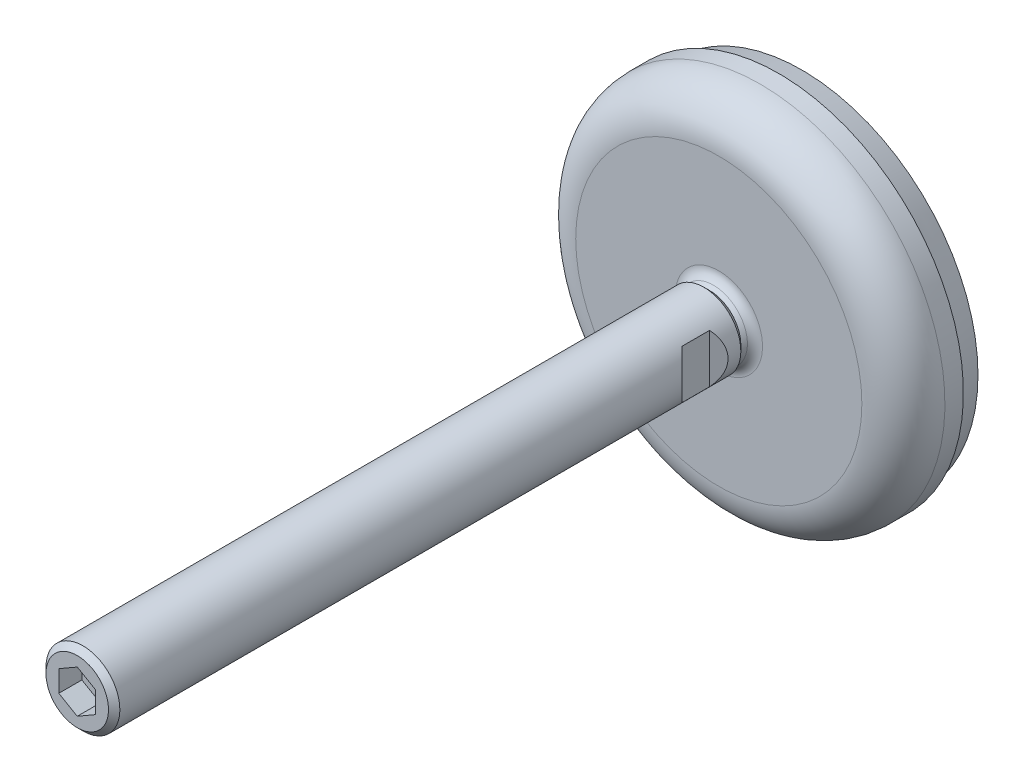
ISO-10303-21;
HEADER;
FILE_DESCRIPTION(('STEP AP214'),'2;1');
FILE_NAME('part.step','',(''),(''),'','','');
FILE_SCHEMA(('AUTOMOTIVE_DESIGN { 1 0 10303 214 1 1 1 1 }'));
ENDSEC;
DATA;
#1=APPLICATION_CONTEXT('core data for automotive mechanical design processes');
#2=APPLICATION_PROTOCOL_DEFINITION('international standard','automotive_design',2000,#1);
#3=PRODUCT_CONTEXT('',#1,'mechanical');
#4=PRODUCT('Part','Part','',(#3));
#5=PRODUCT_RELATED_PRODUCT_CATEGORY('part','',(#4));
#6=PRODUCT_DEFINITION_FORMATION('','',#4);
#7=PRODUCT_DEFINITION_CONTEXT('part definition',#1,'design');
#8=PRODUCT_DEFINITION('design','',#6,#7);
#9=PRODUCT_DEFINITION_SHAPE('','',#8);
#10=(LENGTH_UNIT() NAMED_UNIT(*) SI_UNIT(.MILLI.,.METRE.));
#11=(NAMED_UNIT(*) PLANE_ANGLE_UNIT() SI_UNIT($,.RADIAN.));
#12=(NAMED_UNIT(*) SI_UNIT($,.STERADIAN.) SOLID_ANGLE_UNIT());
#13=UNCERTAINTY_MEASURE_WITH_UNIT(LENGTH_MEASURE(1.E-05),#10,'distance_accuracy_value','');
#14=(GEOMETRIC_REPRESENTATION_CONTEXT(3) GLOBAL_UNCERTAINTY_ASSIGNED_CONTEXT((#13)) GLOBAL_UNIT_ASSIGNED_CONTEXT((#10,
#11,#12)) REPRESENTATION_CONTEXT('',''));
#15=CARTESIAN_POINT('',(0.,0.,0.));
#16=DIRECTION('',(0.,0.,1.));
#17=DIRECTION('',(1.,0.,0.));
#18=AXIS2_PLACEMENT_3D('',#15,#16,#17);
#19=CARTESIAN_POINT('',(0.,0.,21.227));
#20=DIRECTION('',(0.,0.,-1.));
#21=DIRECTION('',(-1.,0.,0.));
#22=AXIS2_PLACEMENT_3D('',#19,#20,#21);
#23=CYLINDRICAL_SURFACE('',#22,8.);
#24=DIRECTION('',(0.,0.,-1.));
#25=VECTOR('',#24,1.);
#26=CARTESIAN_POINT('',(6.,5.29150262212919,21.227));
#27=LINE('',#26,#25);
#28=CARTESIAN_POINT('',(6.,5.29150262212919,26.));
#29=VERTEX_POINT('',#28);
#30=CARTESIAN_POINT('',(6.,5.29150262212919,32.));
#31=VERTEX_POINT('',#30);
#32=EDGE_CURVE('E9',#29,#31,#27,.F.);
#33=ORIENTED_EDGE('',*,*,#32,.F.);
#34=CARTESIAN_POINT('',(0.,0.,32.));
#35=DIRECTION('',(-0.707106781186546,0.,-0.707106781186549));
#36=DIRECTION('',(0.707106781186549,0.,-0.707106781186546));
#37=AXIS2_PLACEMENT_3D('',#34,#35,#36);
#38=ELLIPSE('',#37,11.3137084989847,8.);
#39=CARTESIAN_POINT('',(6.,-5.29150262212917,26.));
#40=VERTEX_POINT('',#39);
#41=EDGE_CURVE('E215',#40,#29,#38,.F.);
#42=ORIENTED_EDGE('',*,*,#41,.F.);
#43=DIRECTION('',(0.,0.,-1.));
#44=VECTOR('',#43,1.);
#45=CARTESIAN_POINT('',(6.,-5.29150262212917,21.227));
#46=LINE('',#45,#44);
#47=CARTESIAN_POINT('',(6.,-5.29150262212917,32.));
#48=VERTEX_POINT('',#47);
#49=EDGE_CURVE('E217',#48,#40,#46,.T.);
#50=ORIENTED_EDGE('',*,*,#49,.F.);
#51=CARTESIAN_POINT('',(0.,0.,26.));
#52=DIRECTION('',(-0.707106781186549,0.,0.707106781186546));
#53=DIRECTION('',(-0.707106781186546,0.,-0.707106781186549));
#54=AXIS2_PLACEMENT_3D('',#51,#52,#53);
#55=ELLIPSE('',#54,11.3137084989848,8.);
#56=EDGE_CURVE('E22',#31,#48,#55,.F.);
#57=ORIENTED_EDGE('',*,*,#56,.F.);
#58=EDGE_LOOP('',(#33,#42,#50,#57));
#59=FACE_BOUND('',#58,.T.);
#60=DIRECTION('',(0.,0.,-1.));
#61=VECTOR('',#60,1.);
#62=CARTESIAN_POINT('',(-6.,-5.29150262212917,21.227));
#63=LINE('',#62,#61);
#64=CARTESIAN_POINT('',(-6.,-5.29150262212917,26.));
#65=VERTEX_POINT('',#64);
#66=CARTESIAN_POINT('',(-6.,-5.29150262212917,32.));
#67=VERTEX_POINT('',#66);
#68=EDGE_CURVE('E209',#65,#67,#63,.F.);
#69=ORIENTED_EDGE('',*,*,#68,.F.);
#70=CARTESIAN_POINT('',(0.,0.,32.));
#71=DIRECTION('',(0.707106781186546,0.,-0.707106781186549));
#72=DIRECTION('',(-0.707106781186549,0.,-0.707106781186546));
#73=AXIS2_PLACEMENT_3D('',#70,#71,#72);
#74=ELLIPSE('',#73,11.3137084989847,8.);
#75=CARTESIAN_POINT('',(-6.,5.29150262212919,26.));
#76=VERTEX_POINT('',#75);
#77=EDGE_CURVE('E212',#76,#65,#74,.F.);
#78=ORIENTED_EDGE('',*,*,#77,.F.);
#79=DIRECTION('',(0.,0.,-1.));
#80=VECTOR('',#79,1.);
#81=CARTESIAN_POINT('',(-6.,5.29150262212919,21.227));
#82=LINE('',#81,#80);
#83=CARTESIAN_POINT('',(-6.,5.29150262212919,32.));
#84=VERTEX_POINT('',#83);
#85=EDGE_CURVE('E186',#84,#76,#82,.T.);
#86=ORIENTED_EDGE('',*,*,#85,.F.);
#87=CARTESIAN_POINT('',(0.,0.,26.));
#88=DIRECTION('',(0.707106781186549,0.,0.707106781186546));
#89=DIRECTION('',(0.707106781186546,0.,-0.707106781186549));
#90=AXIS2_PLACEMENT_3D('',#87,#88,#89);
#91=ELLIPSE('',#90,11.3137084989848,8.);
#92=EDGE_CURVE('E183',#67,#84,#91,.F.);
#93=ORIENTED_EDGE('',*,*,#92,.F.);
#94=EDGE_LOOP('',(#69,#78,#86,#93));
#95=FACE_BOUND('',#94,.T.);
#96=CARTESIAN_POINT('',(0.,0.,155.773));
#97=DIRECTION('',(0.,0.,-1.));
#98=DIRECTION('',(0.,1.,0.));
#99=AXIS2_PLACEMENT_3D('',#96,#97,#98);
#100=CIRCLE('',#99,8.);
#101=CARTESIAN_POINT('',(0.,8.00000000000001,155.773));
#102=VERTEX_POINT('',#101);
#103=EDGE_CURVE('E191',#102,#102,#100,.T.);
#104=ORIENTED_EDGE('',*,*,#103,.T.);
#105=EDGE_LOOP('',(#104));
#106=FACE_BOUND('',#105,.T.);
#107=CARTESIAN_POINT('',(0.,0.,21.227));
#108=DIRECTION('',(0.,0.,-1.));
#109=DIRECTION('',(0.,1.,0.));
#110=AXIS2_PLACEMENT_3D('',#107,#108,#109);
#111=CIRCLE('',#110,8.);
#112=CARTESIAN_POINT('',(0.,8.,21.227));
#113=VERTEX_POINT('',#112);
#114=EDGE_CURVE('E495',#113,#113,#111,.T.);
#115=ORIENTED_EDGE('',*,*,#114,.F.);
#116=EDGE_LOOP('',(#115));
#117=FACE_BOUND('',#116,.T.);
#118=ADVANCED_FACE('F14',(#59,#95,#106,#117),#23,.T.);
#119=CARTESIAN_POINT('',(0.,0.,20.));
#120=DIRECTION('',(0.,0.,1.));
#121=DIRECTION('',(1.,0.,0.));
#122=AXIS2_PLACEMENT_3D('',#119,#120,#121);
#123=CONICAL_SURFACE('',#122,6.773,0.785398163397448);
#124=ORIENTED_EDGE('',*,*,#114,.T.);
#125=EDGE_LOOP('',(#124));
#126=FACE_BOUND('',#125,.T.);
#127=CARTESIAN_POINT('',(0.,0.,20.));
#128=DIRECTION('',(0.,0.,-1.));
#129=DIRECTION('',(-1.,0.,0.));
#130=AXIS2_PLACEMENT_3D('',#127,#128,#129);
#131=CIRCLE('',#130,6.773);
#132=CARTESIAN_POINT('',(-6.773,0.,20.));
#133=VERTEX_POINT('',#132);
#134=EDGE_CURVE('E493',#133,#133,#131,.T.);
#135=ORIENTED_EDGE('',*,*,#134,.F.);
#136=EDGE_LOOP('',(#135));
#137=FACE_BOUND('',#136,.T.);
#138=ADVANCED_FACE('F388',(#126,#137),#123,.T.);
#139=CARTESIAN_POINT('',(1.93614044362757,0.,13.2805600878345));
#140=DIRECTION('',(0.,1.,0.));
#141=DIRECTION('',(-0.176012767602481,0.,-0.984387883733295));
#142=AXIS2_PLACEMENT_3D('',#139,#140,#141);
#143=CIRCLE('',#142,11.0000000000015);
#144=TRIMMED_CURVE('',#143,(PARAMETER_VALUE(0.)),(PARAMETER_VALUE(2.7877236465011)),.T.,.PARAMETER.);
#145=CARTESIAN_POINT('',(0.,0.,13.2805600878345));
#146=DIRECTION('',(0.,0.,-1.));
#147=AXIS1_PLACEMENT('',#145,#146);
#148=SURFACE_OF_REVOLUTION('',#144,#147);
#149=ORIENTED_EDGE('',*,*,#134,.T.);
#150=EDGE_LOOP('',(#149));
#151=FACE_BOUND('',#150,.T.);
#152=CARTESIAN_POINT('',(0.,0.,19.1630666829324));
#153=DIRECTION('',(0.,0.,-1.));
#154=DIRECTION('',(-1.,0.,0.));
#155=AXIS2_PLACEMENT_3D('',#152,#153,#154);
#156=CIRCLE('',#155,7.35881066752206);
#157=CARTESIAN_POINT('',(-7.35881066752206,0.,19.1630666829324));
#158=VERTEX_POINT('',#157);
#159=EDGE_CURVE('E203',#158,#158,#156,.T.);
#160=ORIENTED_EDGE('',*,*,#159,.F.);
#161=EDGE_LOOP('',(#160));
#162=FACE_BOUND('',#161,.T.);
#163=ADVANCED_FACE('F397',(#151,#162),#148,.F.);
#164=CARTESIAN_POINT('',(0.,0.,20.5));
#165=DIRECTION('',(0.,0.,-1.));
#166=DIRECTION('',(-1.,0.,0.));
#167=AXIS2_PLACEMENT_3D('',#164,#165,#166);
#168=TOROIDAL_SURFACE('',#167,9.47129955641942,2.5);
#169=CARTESIAN_POINT('',(0.,0.,18.));
#170=DIRECTION('',(0.,0.,-1.));
#171=DIRECTION('',(-1.,0.,0.));
#172=AXIS2_PLACEMENT_3D('',#169,#170,#171);
#173=CIRCLE('',#172,9.47129955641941);
#174=CARTESIAN_POINT('',(-9.47129955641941,0.,18.));
#175=VERTEX_POINT('',#174);
#176=EDGE_CURVE('E200',#175,#175,#173,.T.);
#177=ORIENTED_EDGE('',*,*,#176,.F.);
#178=EDGE_LOOP('',(#177));
#179=FACE_BOUND('',#178,.T.);
#180=ORIENTED_EDGE('',*,*,#159,.T.);
#181=EDGE_LOOP('',(#180));
#182=FACE_BOUND('',#181,.T.);
#183=ADVANCED_FACE('F407',(#179,#182),#168,.F.);
#184=CARTESIAN_POINT('',(-31.,31.,18.));
#185=CARTESIAN_POINT('',(-31.,-31.,18.));
#186=CARTESIAN_POINT('',(-31.,-31.62,18.));
#187=B_SPLINE_CURVE_WITH_KNOTS('',1,(#184,#185,#186),.UNSPECIFIED.,.F.,.F.,(2,1,2),(0.,1.,1.01),.UNSPECIFIED.);
#188=DIRECTION('',(1.,0.,0.));
#189=VECTOR('',#188,1.);
#190=SURFACE_OF_LINEAR_EXTRUSION('',#187,#189);
#191=ORIENTED_EDGE('',*,*,#176,.T.);
#192=EDGE_LOOP('',(#191));
#193=FACE_BOUND('',#192,.T.);
#194=CARTESIAN_POINT('',(0.,0.,18.));
#195=DIRECTION('',(0.,0.,-1.));
#196=DIRECTION('',(-1.,0.,0.));
#197=AXIS2_PLACEMENT_3D('',#194,#195,#196);
#198=CIRCLE('',#197,31.);
#199=CARTESIAN_POINT('',(-31.,0.,18.));
#200=VERTEX_POINT('',#199);
#201=EDGE_CURVE('E197',#200,#200,#198,.T.);
#202=ORIENTED_EDGE('',*,*,#201,.F.);
#203=EDGE_LOOP('',(#202));
#204=FACE_BOUND('',#203,.T.);
#205=ADVANCED_FACE('F415',(#193,#204),#190,.T.);
#206=CARTESIAN_POINT('',(0.,0.,9.));
#207=DIRECTION('',(0.,0.,-1.));
#208=DIRECTION('',(-1.,0.,0.));
#209=AXIS2_PLACEMENT_3D('',#206,#207,#208);
#210=TOROIDAL_SURFACE('',#209,31.,9.);
#211=ORIENTED_EDGE('',*,*,#201,.T.);
#212=EDGE_LOOP('',(#211));
#213=FACE_BOUND('',#212,.T.);
#214=CARTESIAN_POINT('',(0.,0.,9.));
#215=DIRECTION('',(0.,0.,-1.));
#216=DIRECTION('',(0.,1.,0.));
#217=AXIS2_PLACEMENT_3D('',#214,#215,#216);
#218=CIRCLE('',#217,40.);
#219=CARTESIAN_POINT('',(0.,40.,9.));
#220=VERTEX_POINT('',#219);
#221=EDGE_CURVE('E196',#220,#220,#218,.T.);
#222=ORIENTED_EDGE('',*,*,#221,.F.);
#223=EDGE_LOOP('',(#222));
#224=FACE_BOUND('',#223,.T.);
#225=ADVANCED_FACE('F420',(#213,#224),#210,.T.);
#226=CARTESIAN_POINT('',(0.,0.,5.));
#227=DIRECTION('',(0.,0.,-1.));
#228=DIRECTION('',(-1.,0.,0.));
#229=AXIS2_PLACEMENT_3D('',#226,#227,#228);
#230=CYLINDRICAL_SURFACE('',#229,40.);
#231=CARTESIAN_POINT('',(0.,0.,5.));
#232=DIRECTION('',(0.,0.,-1.));
#233=DIRECTION('',(-1.,0.,0.));
#234=AXIS2_PLACEMENT_3D('',#231,#232,#233);
#235=CIRCLE('',#234,40.);
#236=CARTESIAN_POINT('',(-40.,0.,5.));
#237=VERTEX_POINT('',#236);
#238=EDGE_CURVE('E188',#237,#237,#235,.T.);
#239=ORIENTED_EDGE('',*,*,#238,.F.);
#240=EDGE_LOOP('',(#239));
#241=FACE_BOUND('',#240,.T.);
#242=ORIENTED_EDGE('',*,*,#221,.T.);
#243=EDGE_LOOP('',(#242));
#244=FACE_BOUND('',#243,.T.);
#245=ADVANCED_FACE('F430',(#241,#244),#230,.T.);
#246=CARTESIAN_POINT('',(-40.4800021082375,-40.,5.));
#247=DIRECTION('',(0.,0.,-1.));
#248=DIRECTION('',(0.,1.,0.));
#249=AXIS2_PLACEMENT_3D('',#246,#247,#248);
#250=PLANE('',#249);
#251=CARTESIAN_POINT('',(0.,0.,5.));
#252=DIRECTION('',(0.,0.,1.));
#253=DIRECTION('',(1.,0.,0.));
#254=AXIS2_PLACEMENT_3D('',#251,#252,#253);
#255=CIRCLE('',#254,39.5);
#256=CARTESIAN_POINT('',(39.5,0.,5.));
#257=VERTEX_POINT('',#256);
#258=EDGE_CURVE('E179',#257,#257,#255,.F.);
#259=ORIENTED_EDGE('',*,*,#258,.F.);
#260=EDGE_LOOP('',(#259));
#261=FACE_BOUND('',#260,.T.);
#262=ORIENTED_EDGE('',*,*,#238,.T.);
#263=EDGE_LOOP('',(#262));
#264=FACE_BOUND('',#263,.T.);
#265=ADVANCED_FACE('F174',(#261,#264),#250,.T.);
#266=CARTESIAN_POINT('',(-38.6181791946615,-38.1602540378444,0.));
#267=DIRECTION('',(0.,0.,-1.));
#268=DIRECTION('',(0.,1.,0.));
#269=AXIS2_PLACEMENT_3D('',#266,#267,#268);
#270=PLANE('',#269);
#271=CARTESIAN_POINT('',(0.,0.,0.));
#272=DIRECTION('',(0.,0.,1.));
#273=DIRECTION('',(1.,0.,0.));
#274=AXIS2_PLACEMENT_3D('',#271,#272,#273);
#275=CIRCLE('',#274,38.1602540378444);
#276=CARTESIAN_POINT('',(38.1602540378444,0.,0.));
#277=VERTEX_POINT('',#276);
#278=EDGE_CURVE('E182',#277,#277,#275,.T.);
#279=ORIENTED_EDGE('',*,*,#278,.F.);
#280=EDGE_LOOP('',(#279));
#281=FACE_BOUND('',#280,.T.);
#282=ADVANCED_FACE('F165',(#281),#270,.T.);
#283=CARTESIAN_POINT('',(0.,0.,0.));
#284=DIRECTION('',(0.,0.,1.));
#285=DIRECTION('',(1.,0.,0.));
#286=AXIS2_PLACEMENT_3D('',#283,#284,#285);
#287=CONICAL_SURFACE('',#286,38.1602540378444,0.261799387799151);
#288=ORIENTED_EDGE('',*,*,#258,.T.);
#289=EDGE_LOOP('',(#288));
#290=FACE_BOUND('',#289,.T.);
#291=ORIENTED_EDGE('',*,*,#278,.T.);
#292=EDGE_LOOP('',(#291));
#293=FACE_BOUND('',#292,.T.);
#294=ADVANCED_FACE('F16',(#290,#293),#287,.T.);
#295=CARTESIAN_POINT('',(-4.,-4.6742277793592,152.));
#296=DIRECTION('',(0.,0.,1.));
#297=DIRECTION('',(1.,0.,0.));
#298=AXIS2_PLACEMENT_3D('',#295,#296,#297);
#299=PLANE('',#298);
#300=DIRECTION('',(0.866025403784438,0.5,0.));
#301=VECTOR('',#300,1.);
#302=CARTESIAN_POINT('',(-2.,3.46410161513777,152.));
#303=LINE('',#302,#301);
#304=CARTESIAN_POINT('',(-4.,2.30940107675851,152.));
#305=VERTEX_POINT('',#304);
#306=CARTESIAN_POINT('',(1.08254330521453E-07,4.61880209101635,152.));
#307=VERTEX_POINT('',#306);
#308=EDGE_CURVE('E138',#305,#307,#303,.T.);
#309=ORIENTED_EDGE('',*,*,#308,.F.);
#310=DIRECTION('',(0.,1.,0.));
#311=VECTOR('',#310,1.);
#312=CARTESIAN_POINT('',(-4.,0.,152.));
#313=LINE('',#312,#311);
#314=CARTESIAN_POINT('',(-4.,-2.30940107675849,152.));
#315=VERTEX_POINT('',#314);
#316=EDGE_CURVE('E72',#315,#305,#313,.T.);
#317=ORIENTED_EDGE('',*,*,#316,.F.);
#318=DIRECTION('',(-0.866025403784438,0.5,0.));
#319=VECTOR('',#318,1.);
#320=CARTESIAN_POINT('',(-2.,-3.46410161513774,152.));
#321=LINE('',#320,#319);
#322=CARTESIAN_POINT('',(-2.16508660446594E-07,-4.61880202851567,152.));
#323=VERTEX_POINT('',#322);
#324=EDGE_CURVE('E68',#323,#315,#321,.T.);
#325=ORIENTED_EDGE('',*,*,#324,.F.);
#326=DIRECTION('',(-0.866025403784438,-0.5,0.));
#327=VECTOR('',#326,1.);
#328=CARTESIAN_POINT('',(2.,-3.46410161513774,152.));
#329=LINE('',#328,#327);
#330=CARTESIAN_POINT('',(4.,-2.30940107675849,152.));
#331=VERTEX_POINT('',#330);
#332=EDGE_CURVE('E91',#331,#323,#329,.T.);
#333=ORIENTED_EDGE('',*,*,#332,.F.);
#334=DIRECTION('',(0.,-1.,0.));
#335=VECTOR('',#334,1.);
#336=CARTESIAN_POINT('',(4.,0.,152.));
#337=LINE('',#336,#335);
#338=CARTESIAN_POINT('',(4.,2.30940107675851,152.));
#339=VERTEX_POINT('',#338);
#340=EDGE_CURVE('E149',#339,#331,#337,.T.);
#341=ORIENTED_EDGE('',*,*,#340,.F.);
#342=DIRECTION('',(0.866025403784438,-0.5,0.));
#343=VECTOR('',#342,1.);
#344=CARTESIAN_POINT('',(2.,3.46410161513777,152.));
#345=LINE('',#344,#343);
#346=EDGE_CURVE('E142',#307,#339,#345,.T.);
#347=ORIENTED_EDGE('',*,*,#346,.F.);
#348=EDGE_LOOP('',(#309,#317,#325,#333,#341,#347));
#349=FACE_BOUND('',#348,.T.);
#350=ADVANCED_FACE('F164',(#349),#299,.T.);
#351=CARTESIAN_POINT('',(4.,2.30940107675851,157.));
#352=DIRECTION('',(-0.5,-0.866025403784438,0.));
#353=DIRECTION('',(-0.866025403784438,0.5,0.));
#354=AXIS2_PLACEMENT_3D('',#351,#352,#353);
#355=PLANE('',#354);
#356=ORIENTED_EDGE('',*,*,#346,.T.);
#357=DIRECTION('',(0.,0.,-1.));
#358=VECTOR('',#357,1.);
#359=CARTESIAN_POINT('',(4.,2.30940107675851,157.));
#360=LINE('',#359,#358);
#361=CARTESIAN_POINT('',(4.,2.30940107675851,157.));
#362=VERTEX_POINT('',#361);
#363=EDGE_CURVE('E146',#362,#339,#360,.T.);
#364=ORIENTED_EDGE('',*,*,#363,.F.);
#365=CARTESIAN_POINT('',(0.,4.61880215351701,157.));
#366=CARTESIAN_POINT('',(0.166666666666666,4.52257710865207,157.));
#367=CARTESIAN_POINT('',(0.333333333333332,4.42635206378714,157.));
#368=CARTESIAN_POINT('',(0.666666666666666,4.23390197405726,157.));
#369=CARTESIAN_POINT('',(0.833333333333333,4.13767692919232,157.));
#370=CARTESIAN_POINT('',(1.16666666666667,3.94522683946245,157.));
#371=CARTESIAN_POINT('',(1.33333333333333,3.84900179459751,157.));
#372=CARTESIAN_POINT('',(1.66666666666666,3.65655170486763,157.));
#373=CARTESIAN_POINT('',(1.83333333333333,3.56032666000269,157.));
#374=CARTESIAN_POINT('',(2.16666666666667,3.36787657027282,157.));
#375=CARTESIAN_POINT('',(2.33333333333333,3.27165152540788,157.));
#376=CARTESIAN_POINT('',(2.66666666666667,3.079201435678,157.));
#377=CARTESIAN_POINT('',(2.83333333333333,2.98297639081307,157.));
#378=CARTESIAN_POINT('',(3.16666666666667,2.79052630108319,157.));
#379=CARTESIAN_POINT('',(3.33333333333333,2.69430125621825,157.));
#380=CARTESIAN_POINT('',(3.66666666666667,2.50185116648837,157.));
#381=CARTESIAN_POINT('',(3.83333333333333,2.40562612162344,157.));
#382=CARTESIAN_POINT('',(4.,2.3094010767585,157.));
#383=B_SPLINE_CURVE_WITH_KNOTS('',3,(#365,#366,#367,#368,#369,#370,#371,#372,#373,#374,#375,
#376,#377,#378,#379,#380,#381,#382),.UNSPECIFIED.,.F.,.F.,(4,2,2,2,2,2,2,2,4),(0.,
0.577350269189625,1.15470053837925,1.73205080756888,2.3094010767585,2.88675134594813,
3.46410161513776,4.04145188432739,4.61880215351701),.UNSPECIFIED.);
#384=CARTESIAN_POINT('',(-6.2517199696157E-08,4.6188021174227,157.));
#385=VERTEX_POINT('',#384);
#386=EDGE_CURVE('E120',#385,#362,#383,.T.);
#387=ORIENTED_EDGE('',*,*,#386,.F.);
#388=DIRECTION('',(0.,0.,-1.));
#389=VECTOR('',#388,1.);
#390=CARTESIAN_POINT('',(0.,4.61880215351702,157.));
#391=LINE('',#390,#389);
#392=EDGE_CURVE('E135',#385,#307,#391,.T.);
#393=ORIENTED_EDGE('',*,*,#392,.T.);
#394=EDGE_LOOP('',(#356,#364,#387,#393));
#395=FACE_BOUND('',#394,.T.);
#396=ADVANCED_FACE('F144',(#395),#355,.T.);
#397=CARTESIAN_POINT('',(0.,4.61880215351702,157.));
#398=DIRECTION('',(0.5,-0.866025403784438,0.));
#399=DIRECTION('',(-0.866025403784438,-0.5,0.));
#400=AXIS2_PLACEMENT_3D('',#397,#398,#399);
#401=PLANE('',#400);
#402=ORIENTED_EDGE('',*,*,#308,.T.);
#403=ORIENTED_EDGE('',*,*,#392,.F.);
#404=CARTESIAN_POINT('',(-4.,2.3094010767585,157.));
#405=CARTESIAN_POINT('',(-3.83333333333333,2.40562612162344,157.));
#406=CARTESIAN_POINT('',(-3.66666666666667,2.50185116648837,157.));
#407=CARTESIAN_POINT('',(-3.33333333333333,2.69430125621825,157.));
#408=CARTESIAN_POINT('',(-3.16666666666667,2.79052630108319,157.));
#409=CARTESIAN_POINT('',(-2.83333333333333,2.98297639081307,157.));
#410=CARTESIAN_POINT('',(-2.66666666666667,3.079201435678,157.));
#411=CARTESIAN_POINT('',(-2.33333333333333,3.27165152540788,157.));
#412=CARTESIAN_POINT('',(-2.16666666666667,3.36787657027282,157.));
#413=CARTESIAN_POINT('',(-1.83333333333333,3.56032666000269,157.));
#414=CARTESIAN_POINT('',(-1.66666666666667,3.65655170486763,157.));
#415=CARTESIAN_POINT('',(-1.33333333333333,3.84900179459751,157.));
#416=CARTESIAN_POINT('',(-1.16666666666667,3.94522683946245,157.));
#417=CARTESIAN_POINT('',(-0.833333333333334,4.13767692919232,157.));
#418=CARTESIAN_POINT('',(-0.666666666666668,4.23390197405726,157.));
#419=CARTESIAN_POINT('',(-0.333333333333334,4.42635206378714,157.));
#420=CARTESIAN_POINT('',(-0.166666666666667,4.52257710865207,157.));
#421=CARTESIAN_POINT('',(0.,4.61880215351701,157.));
#422=B_SPLINE_CURVE_WITH_KNOTS('',3,(#404,#405,#406,#407,#408,#409,#410,#411,#412,#413,#414,
#415,#416,#417,#418,#419,#420,#421),.UNSPECIFIED.,.F.,.F.,(4,2,2,2,2,2,2,2,4),(0.,
0.577350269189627,1.15470053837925,1.73205080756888,2.3094010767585,2.88675134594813,
3.46410161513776,4.04145188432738,4.61880215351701),.UNSPECIFIED.);
#423=CARTESIAN_POINT('',(-4.,2.30940107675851,157.));
#424=VERTEX_POINT('',#423);
#425=EDGE_CURVE('E82',#424,#385,#422,.T.);
#426=ORIENTED_EDGE('',*,*,#425,.F.);
#427=DIRECTION('',(0.,0.,-1.));
#428=VECTOR('',#427,1.);
#429=CARTESIAN_POINT('',(-4.,2.30940107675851,157.));
#430=LINE('',#429,#428);
#431=EDGE_CURVE('E78',#424,#305,#430,.T.);
#432=ORIENTED_EDGE('',*,*,#431,.T.);
#433=EDGE_LOOP('',(#402,#403,#426,#432));
#434=FACE_BOUND('',#433,.T.);
#435=ADVANCED_FACE('F132',(#434),#401,.T.);
#436=CARTESIAN_POINT('',(-4.,2.30940107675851,157.));
#437=DIRECTION('',(1.,0.,0.));
#438=DIRECTION('',(0.,-1.,0.));
#439=AXIS2_PLACEMENT_3D('',#436,#437,#438);
#440=PLANE('',#439);
#441=ORIENTED_EDGE('',*,*,#316,.T.);
#442=ORIENTED_EDGE('',*,*,#431,.F.);
#443=DIRECTION('',(0.,1.,0.));
#444=VECTOR('',#443,1.);
#445=CARTESIAN_POINT('',(-4.,0.,157.));
#446=LINE('',#445,#444);
#447=CARTESIAN_POINT('',(-4.,-2.30940107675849,157.));
#448=VERTEX_POINT('',#447);
#449=EDGE_CURVE('E75',#448,#424,#446,.T.);
#450=ORIENTED_EDGE('',*,*,#449,.F.);
#451=DIRECTION('',(0.,0.,-1.));
#452=VECTOR('',#451,1.);
#453=CARTESIAN_POINT('',(-4.,-2.30940107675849,157.));
#454=LINE('',#453,#452);
#455=EDGE_CURVE('E59',#448,#315,#454,.T.);
#456=ORIENTED_EDGE('',*,*,#455,.T.);
#457=EDGE_LOOP('',(#441,#442,#450,#456));
#458=FACE_BOUND('',#457,.T.);
#459=ADVANCED_FACE('F76',(#458),#440,.T.);
#460=CARTESIAN_POINT('',(-4.,-2.30940107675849,157.));
#461=DIRECTION('',(0.5,0.866025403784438,0.));
#462=DIRECTION('',(0.866025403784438,-0.5,0.));
#463=AXIS2_PLACEMENT_3D('',#460,#461,#462);
#464=PLANE('',#463);
#465=ORIENTED_EDGE('',*,*,#324,.T.);
#466=ORIENTED_EDGE('',*,*,#455,.F.);
#467=CARTESIAN_POINT('',(0.,-4.61880215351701,157.));
#468=CARTESIAN_POINT('',(-0.166666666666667,-4.52257710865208,157.));
#469=CARTESIAN_POINT('',(-0.333333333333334,-4.42635206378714,157.));
#470=CARTESIAN_POINT('',(-0.666666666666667,-4.23390197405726,157.));
#471=CARTESIAN_POINT('',(-0.833333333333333,-4.13767692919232,157.));
#472=CARTESIAN_POINT('',(-1.16666666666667,-3.94522683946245,157.));
#473=CARTESIAN_POINT('',(-1.33333333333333,-3.84900179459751,157.));
#474=CARTESIAN_POINT('',(-1.66666666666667,-3.65655170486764,157.));
#475=CARTESIAN_POINT('',(-1.83333333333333,-3.5603266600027,157.));
#476=CARTESIAN_POINT('',(-2.16666666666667,-3.36787657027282,157.));
#477=CARTESIAN_POINT('',(-2.33333333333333,-3.27165152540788,157.));
#478=CARTESIAN_POINT('',(-2.66666666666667,-3.07920143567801,157.));
#479=CARTESIAN_POINT('',(-2.83333333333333,-2.98297639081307,157.));
#480=CARTESIAN_POINT('',(-3.16666666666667,-2.7905263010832,157.));
#481=CARTESIAN_POINT('',(-3.33333333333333,-2.69430125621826,157.));
#482=CARTESIAN_POINT('',(-3.66666666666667,-2.50185116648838,157.));
#483=CARTESIAN_POINT('',(-3.83333333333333,-2.40562612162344,157.));
#484=CARTESIAN_POINT('',(-4.,-2.30940107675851,157.));
#485=B_SPLINE_CURVE_WITH_KNOTS('',3,(#467,#468,#469,#470,#471,#472,#473,#474,#475,#476,#477,
#478,#479,#480,#481,#482,#483,#484),.UNSPECIFIED.,.F.,.F.,(4,2,2,2,2,2,2,2,4),(0.,
0.577350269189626,1.15470053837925,1.73205080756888,2.3094010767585,2.88675134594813,
3.46410161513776,4.04145188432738,4.61880215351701),.UNSPECIFIED.);
#486=CARTESIAN_POINT('',(-6.25172003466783E-08,-4.61880211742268,157.));
#487=VERTEX_POINT('',#486);
#488=EDGE_CURVE('E64',#487,#448,#485,.T.);
#489=ORIENTED_EDGE('',*,*,#488,.F.);
#490=DIRECTION('',(0.,0.,-1.));
#491=VECTOR('',#490,1.);
#492=CARTESIAN_POINT('',(0.,-4.618802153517,157.));
#493=LINE('',#492,#491);
#494=EDGE_CURVE('E89',#323,#487,#493,.F.);
#495=ORIENTED_EDGE('',*,*,#494,.F.);
#496=EDGE_LOOP('',(#465,#466,#489,#495));
#497=FACE_BOUND('',#496,.T.);
#498=ADVANCED_FACE('F61',(#497),#464,.T.);
#499=CARTESIAN_POINT('',(0.,-4.618802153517,157.));
#500=DIRECTION('',(-0.5,0.866025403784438,0.));
#501=DIRECTION('',(0.866025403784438,0.5,0.));
#502=AXIS2_PLACEMENT_3D('',#499,#500,#501);
#503=PLANE('',#502);
#504=ORIENTED_EDGE('',*,*,#332,.T.);
#505=ORIENTED_EDGE('',*,*,#494,.T.);
#506=CARTESIAN_POINT('',(4.,-2.30940107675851,157.));
#507=CARTESIAN_POINT('',(3.83333333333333,-2.40562612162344,157.));
#508=CARTESIAN_POINT('',(3.66666666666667,-2.50185116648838,157.));
#509=CARTESIAN_POINT('',(3.33333333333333,-2.69430125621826,157.));
#510=CARTESIAN_POINT('',(3.16666666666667,-2.7905263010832,157.));
#511=CARTESIAN_POINT('',(2.83333333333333,-2.98297639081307,157.));
#512=CARTESIAN_POINT('',(2.66666666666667,-3.07920143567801,157.));
#513=CARTESIAN_POINT('',(2.33333333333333,-3.27165152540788,157.));
#514=CARTESIAN_POINT('',(2.16666666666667,-3.36787657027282,157.));
#515=CARTESIAN_POINT('',(1.83333333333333,-3.5603266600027,157.));
#516=CARTESIAN_POINT('',(1.66666666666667,-3.65655170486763,157.));
#517=CARTESIAN_POINT('',(1.33333333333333,-3.84900179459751,157.));
#518=CARTESIAN_POINT('',(1.16666666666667,-3.94522683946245,157.));
#519=CARTESIAN_POINT('',(0.833333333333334,-4.13767692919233,157.));
#520=CARTESIAN_POINT('',(0.666666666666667,-4.23390197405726,157.));
#521=CARTESIAN_POINT('',(0.333333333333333,-4.42635206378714,157.));
#522=CARTESIAN_POINT('',(0.166666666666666,-4.52257710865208,157.));
#523=CARTESIAN_POINT('',(0.,-4.61880215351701,157.));
#524=B_SPLINE_CURVE_WITH_KNOTS('',3,(#506,#507,#508,#509,#510,#511,#512,#513,#514,#515,#516,
#517,#518,#519,#520,#521,#522,#523),.UNSPECIFIED.,.F.,.F.,(4,2,2,2,2,2,2,2,4),(0.,
0.577350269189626,1.15470053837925,1.73205080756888,2.3094010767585,2.88675134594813,
3.46410161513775,4.04145188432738,4.61880215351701),.UNSPECIFIED.);
#525=CARTESIAN_POINT('',(4.,-2.30940107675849,157.));
#526=VERTEX_POINT('',#525);
#527=EDGE_CURVE('E88',#526,#487,#524,.T.);
#528=ORIENTED_EDGE('',*,*,#527,.F.);
#529=DIRECTION('',(0.,0.,-1.));
#530=VECTOR('',#529,1.);
#531=CARTESIAN_POINT('',(4.,-2.30940107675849,157.));
#532=LINE('',#531,#530);
#533=EDGE_CURVE('E37',#526,#331,#532,.T.);
#534=ORIENTED_EDGE('',*,*,#533,.T.);
#535=EDGE_LOOP('',(#504,#505,#528,#534));
#536=FACE_BOUND('',#535,.T.);
#537=ADVANCED_FACE('F111',(#536),#503,.T.);
#538=CARTESIAN_POINT('',(4.,-2.30940107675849,157.));
#539=DIRECTION('',(-1.,0.,0.));
#540=DIRECTION('',(0.,1.,0.));
#541=AXIS2_PLACEMENT_3D('',#538,#539,#540);
#542=PLANE('',#541);
#543=ORIENTED_EDGE('',*,*,#340,.T.);
#544=ORIENTED_EDGE('',*,*,#533,.F.);
#545=DIRECTION('',(0.,-1.,0.));
#546=VECTOR('',#545,1.);
#547=CARTESIAN_POINT('',(4.,0.,157.));
#548=LINE('',#547,#546);
#549=EDGE_CURVE('E123',#362,#526,#548,.T.);
#550=ORIENTED_EDGE('',*,*,#549,.F.);
#551=ORIENTED_EDGE('',*,*,#363,.T.);
#552=EDGE_LOOP('',(#543,#544,#550,#551));
#553=FACE_BOUND('',#552,.T.);
#554=ADVANCED_FACE('F151',(#553),#542,.T.);
#555=CARTESIAN_POINT('',(-6.85427810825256,6.773,157.));
#556=DIRECTION('',(0.,0.,1.));
#557=DIRECTION('',(0.,-1.,0.));
#558=AXIS2_PLACEMENT_3D('',#555,#556,#557);
#559=PLANE('',#558);
#560=ORIENTED_EDGE('',*,*,#549,.T.);
#561=ORIENTED_EDGE('',*,*,#527,.T.);
#562=ORIENTED_EDGE('',*,*,#488,.T.);
#563=ORIENTED_EDGE('',*,*,#449,.T.);
#564=ORIENTED_EDGE('',*,*,#425,.T.);
#565=ORIENTED_EDGE('',*,*,#386,.T.);
#566=EDGE_LOOP('',(#560,#561,#562,#563,#564,#565));
#567=FACE_BOUND('',#566,.T.);
#568=CARTESIAN_POINT('',(0.,0.,157.));
#569=DIRECTION('',(0.,0.,-1.));
#570=DIRECTION('',(-1.,0.,0.));
#571=AXIS2_PLACEMENT_3D('',#568,#569,#570);
#572=CIRCLE('',#571,6.773);
#573=CARTESIAN_POINT('',(-6.773,0.,157.));
#574=VERTEX_POINT('',#573);
#575=EDGE_CURVE('E204',#574,#574,#572,.T.);
#576=ORIENTED_EDGE('',*,*,#575,.F.);
#577=EDGE_LOOP('',(#576));
#578=FACE_BOUND('',#577,.T.);
#579=ADVANCED_FACE('F86',(#567,#578),#559,.T.);
#580=CARTESIAN_POINT('',(0.,0.,157.));
#581=DIRECTION('',(0.,0.,-1.));
#582=DIRECTION('',(-1.,0.,0.));
#583=AXIS2_PLACEMENT_3D('',#580,#581,#582);
#584=CONICAL_SURFACE('',#583,6.773,0.785398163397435);
#585=ORIENTED_EDGE('',*,*,#103,.F.);
#586=EDGE_LOOP('',(#585));
#587=FACE_BOUND('',#586,.T.);
#588=ORIENTED_EDGE('',*,*,#575,.T.);
#589=EDGE_LOOP('',(#588));
#590=FACE_BOUND('',#589,.T.);
#591=ADVANCED_FACE('F160',(#587,#590),#584,.T.);
#592=CARTESIAN_POINT('',(-8.,-10.,24.));
#593=DIRECTION('',(0.707106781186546,0.,-0.707106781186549));
#594=DIRECTION('',(-0.707106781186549,0.,-0.707106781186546));
#595=AXIS2_PLACEMENT_3D('',#592,#593,#594);
#596=PLANE('',#595);
#597=ORIENTED_EDGE('',*,*,#77,.T.);
#598=DIRECTION('',(0.,1.,0.));
#599=VECTOR('',#598,1.);
#600=CARTESIAN_POINT('',(-6.,-10.,26.));
#601=LINE('',#600,#599);
#602=EDGE_CURVE('E242',#65,#76,#601,.T.);
#603=ORIENTED_EDGE('',*,*,#602,.T.);
#604=EDGE_LOOP('',(#597,#603));
#605=FACE_BOUND('',#604,.T.);
#606=ADVANCED_FACE('F286',(#605),#596,.F.);
#607=CARTESIAN_POINT('',(-6.,-10.,26.));
#608=DIRECTION('',(1.,0.,0.));
#609=DIRECTION('',(0.,0.,-1.));
#610=AXIS2_PLACEMENT_3D('',#607,#608,#609);
#611=PLANE('',#610);
#612=ORIENTED_EDGE('',*,*,#68,.T.);
#613=DIRECTION('',(0.,1.,0.));
#614=VECTOR('',#613,1.);
#615=CARTESIAN_POINT('',(-6.,-10.,32.));
#616=LINE('',#615,#614);
#617=EDGE_CURVE('E235',#67,#84,#616,.T.);
#618=ORIENTED_EDGE('',*,*,#617,.T.);
#619=ORIENTED_EDGE('',*,*,#85,.T.);
#620=ORIENTED_EDGE('',*,*,#602,.F.);
#621=EDGE_LOOP('',(#612,#618,#619,#620));
#622=FACE_BOUND('',#621,.T.);
#623=ADVANCED_FACE('F276',(#622),#611,.F.);
#624=CARTESIAN_POINT('',(-6.,-10.,32.));
#625=DIRECTION('',(0.707106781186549,0.,0.707106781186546));
#626=DIRECTION('',(0.707106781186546,0.,-0.707106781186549));
#627=AXIS2_PLACEMENT_3D('',#624,#625,#626);
#628=PLANE('',#627);
#629=ORIENTED_EDGE('',*,*,#617,.F.);
#630=ORIENTED_EDGE('',*,*,#92,.T.);
#631=EDGE_LOOP('',(#629,#630));
#632=FACE_BOUND('',#631,.T.);
#633=ADVANCED_FACE('F277',(#632),#628,.F.);
#634=CARTESIAN_POINT('',(6.,-10.,32.));
#635=DIRECTION('',(-0.707106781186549,0.,0.707106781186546));
#636=DIRECTION('',(0.707106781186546,0.,0.707106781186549));
#637=AXIS2_PLACEMENT_3D('',#634,#635,#636);
#638=PLANE('',#637);
#639=DIRECTION('',(0.,1.,0.));
#640=VECTOR('',#639,1.);
#641=CARTESIAN_POINT('',(6.,-10.,32.));
#642=LINE('',#641,#640);
#643=EDGE_CURVE('E226',#48,#31,#642,.T.);
#644=ORIENTED_EDGE('',*,*,#643,.T.);
#645=ORIENTED_EDGE('',*,*,#56,.T.);
#646=EDGE_LOOP('',(#644,#645));
#647=FACE_BOUND('',#646,.T.);
#648=ADVANCED_FACE('F224',(#647),#638,.F.);
#649=CARTESIAN_POINT('',(6.,-10.,26.));
#650=DIRECTION('',(-1.,0.,0.));
#651=DIRECTION('',(0.,0.,1.));
#652=AXIS2_PLACEMENT_3D('',#649,#650,#651);
#653=PLANE('',#652);
#654=ORIENTED_EDGE('',*,*,#32,.T.);
#655=ORIENTED_EDGE('',*,*,#643,.F.);
#656=ORIENTED_EDGE('',*,*,#49,.T.);
#657=DIRECTION('',(0.,1.,0.));
#658=VECTOR('',#657,1.);
#659=CARTESIAN_POINT('',(6.,-10.,26.));
#660=LINE('',#659,#658);
#661=EDGE_CURVE('E28',#40,#29,#660,.T.);
#662=ORIENTED_EDGE('',*,*,#661,.T.);
#663=EDGE_LOOP('',(#654,#655,#656,#662));
#664=FACE_BOUND('',#663,.T.);
#665=ADVANCED_FACE('F233',(#664),#653,.F.);
#666=CARTESIAN_POINT('',(8.,-10.,24.));
#667=DIRECTION('',(-0.707106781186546,0.,-0.707106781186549));
#668=DIRECTION('',(-0.707106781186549,0.,0.707106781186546));
#669=AXIS2_PLACEMENT_3D('',#666,#667,#668);
#670=PLANE('',#669);
#671=ORIENTED_EDGE('',*,*,#41,.T.);
#672=ORIENTED_EDGE('',*,*,#661,.F.);
#673=EDGE_LOOP('',(#671,#672));
#674=FACE_BOUND('',#673,.T.);
#675=ADVANCED_FACE('F238',(#674),#670,.F.);
#676=CLOSED_SHELL('',(#118,#138,#163,#183,#205,#225,#245,#265,#282,#294,#350,#396,#435,#459,
#498,#537,#554,#579,#591,#606,#623,#633,#648,#665,#675));
#677=MANIFOLD_SOLID_BREP('B1',#676);
#678=ADVANCED_BREP_SHAPE_REPRESENTATION('',(#18,#677),#14);
#679=SHAPE_DEFINITION_REPRESENTATION(#9,#678);
ENDSEC;
END-ISO-10303-21;
